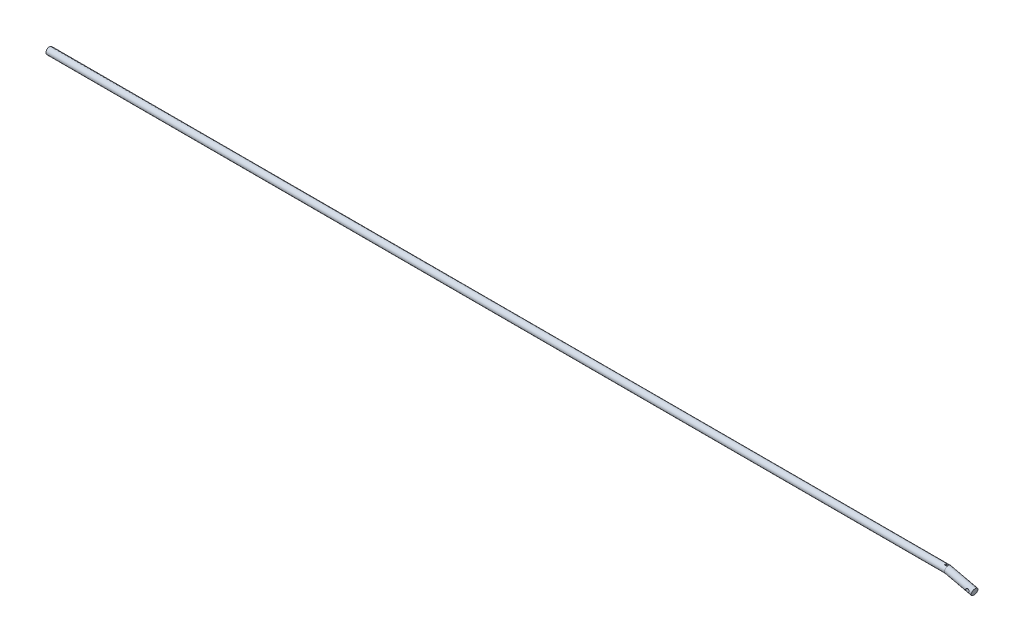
ISO-10303-21;
HEADER;
FILE_DESCRIPTION(('STEP AP214'),'2;1');
FILE_NAME('part.step','',(''),(''),'','','');
FILE_SCHEMA(('AUTOMOTIVE_DESIGN { 1 0 10303 214 1 1 1 1 }'));
ENDSEC;
DATA;
#1=APPLICATION_CONTEXT('core data for automotive mechanical design processes');
#2=APPLICATION_PROTOCOL_DEFINITION('international standard','automotive_design',2000,#1);
#3=PRODUCT_CONTEXT('',#1,'mechanical');
#4=PRODUCT('Part','Part','',(#3));
#5=PRODUCT_RELATED_PRODUCT_CATEGORY('part','',(#4));
#6=PRODUCT_DEFINITION_FORMATION('','',#4);
#7=PRODUCT_DEFINITION_CONTEXT('part definition',#1,'design');
#8=PRODUCT_DEFINITION('design','',#6,#7);
#9=PRODUCT_DEFINITION_SHAPE('','',#8);
#10=(LENGTH_UNIT() NAMED_UNIT(*) SI_UNIT(.MILLI.,.METRE.));
#11=(NAMED_UNIT(*) PLANE_ANGLE_UNIT() SI_UNIT($,.RADIAN.));
#12=(NAMED_UNIT(*) SI_UNIT($,.STERADIAN.) SOLID_ANGLE_UNIT());
#13=UNCERTAINTY_MEASURE_WITH_UNIT(LENGTH_MEASURE(1.E-05),#10,'distance_accuracy_value','');
#14=(GEOMETRIC_REPRESENTATION_CONTEXT(3) GLOBAL_UNCERTAINTY_ASSIGNED_CONTEXT((#13)) GLOBAL_UNIT_ASSIGNED_CONTEXT((#10,
#11,#12)) REPRESENTATION_CONTEXT('',''));
#15=CARTESIAN_POINT('',(0.,0.,0.));
#16=DIRECTION('',(0.,0.,1.));
#17=DIRECTION('',(1.,0.,0.));
#18=AXIS2_PLACEMENT_3D('',#15,#16,#17);
#19=CARTESIAN_POINT('',(1065.48022611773,0.,0.));
#20=DIRECTION('',(0.974370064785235,-0.224951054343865,0.));
#21=DIRECTION('',(0.224951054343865,0.974370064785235,0.));
#22=AXIS2_PLACEMENT_3D('',#19,#20,#21);
#23=CYLINDRICAL_SURFACE('',#22,4.);
#24=CARTESIAN_POINT('',(1094.3717638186,-6.67013704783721,-4.));
#25=CARTESIAN_POINT('',(1094.34915611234,-6.76803627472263,-3.99999513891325));
#26=CARTESIAN_POINT('',(1094.31871721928,-6.86426835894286,-3.9961727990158));
#27=CARTESIAN_POINT('',(1094.2432164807,-7.05034269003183,-3.98126038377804));
#28=CARTESIAN_POINT('',(1094.1981234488,-7.14017080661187,-3.97015475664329));
#29=CARTESIAN_POINT('',(1094.0951176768,-7.31059243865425,-3.94184589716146));
#30=CARTESIAN_POINT('',(1094.03725335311,-7.39121913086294,-3.92466555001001));
#31=CARTESIAN_POINT('',(1093.91040734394,-7.54186564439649,-3.88581306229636));
#32=CARTESIAN_POINT('',(1093.84142727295,-7.61188700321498,-3.86414157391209));
#33=CARTESIAN_POINT('',(1093.68989672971,-7.74375164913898,-3.81690967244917));
#34=CARTESIAN_POINT('',(1093.60680163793,-7.80491463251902,-3.79119919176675));
#35=CARTESIAN_POINT('',(1093.43189355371,-7.91302126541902,-3.73932387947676));
#36=CARTESIAN_POINT('',(1093.34007467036,-7.95995521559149,-3.71315875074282));
#37=CARTESIAN_POINT('',(1093.1429997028,-8.04121865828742,-3.66129888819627));
#38=CARTESIAN_POINT('',(1093.03725429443,-8.0744706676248,-3.63575784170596));
#39=CARTESIAN_POINT('',(1092.82039917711,-8.12218178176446,-3.59051183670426));
#40=CARTESIAN_POINT('',(1092.70929305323,-8.13665327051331,-3.57080303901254));
#41=CARTESIAN_POINT('',(1092.49139953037,-8.14545202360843,-3.54112541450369));
#42=CARTESIAN_POINT('',(1092.38472651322,-8.14087952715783,-3.53066583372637));
#43=CARTESIAN_POINT('',(1092.17320239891,-8.11376061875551,-3.51932216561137));
#44=CARTESIAN_POINT('',(1092.06834986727,-8.09122908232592,-3.51843016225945));
#45=CARTESIAN_POINT('',(1091.87506945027,-8.03230893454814,-3.5259205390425));
#46=CARTESIAN_POINT('',(1091.78607460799,-7.99762912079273,-3.53333630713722));
#47=CARTESIAN_POINT('',(1091.61493330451,-7.91575800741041,-3.5549317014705));
#48=CARTESIAN_POINT('',(1091.5327887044,-7.86856332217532,-3.56911315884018));
#49=CARTESIAN_POINT('',(1091.37531922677,-7.76191056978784,-3.60296787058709));
#50=CARTESIAN_POINT('',(1091.30019681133,-7.7021933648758,-3.62276091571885));
#51=CARTESIAN_POINT('',(1091.16023536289,-7.5727246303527,-3.6656024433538));
#52=CARTESIAN_POINT('',(1091.09540089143,-7.50296867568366,-3.68865236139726));
#53=CARTESIAN_POINT('',(1090.97030224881,-7.34642679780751,-3.73856394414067));
#54=CARTESIAN_POINT('',(1090.91138161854,-7.25860725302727,-3.76556206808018));
#55=CARTESIAN_POINT('',(1090.80873102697,-7.07407487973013,-3.8181912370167));
#56=CARTESIAN_POINT('',(1090.7650070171,-6.97735858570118,-3.84382174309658));
#57=CARTESIAN_POINT('',(1090.69270375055,-6.77325654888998,-3.89203005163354));
#58=CARTESIAN_POINT('',(1090.66476539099,-6.6656046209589,-3.91445422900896));
#59=CARTESIAN_POINT('',(1090.62808312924,-6.44591440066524,-3.95246172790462));
#60=CARTESIAN_POINT('',(1090.61932540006,-6.33387932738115,-3.96804997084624));
#61=CARTESIAN_POINT('',(1090.62173610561,-6.1178240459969,-3.98962347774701));
#62=CARTESIAN_POINT('',(1090.63141923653,-6.01385240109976,-3.99625687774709));
#63=CARTESIAN_POINT('',(1090.66776543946,-5.80873035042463,-4.00134617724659));
#64=CARTESIAN_POINT('',(1090.69442158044,-5.70757881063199,-3.99980541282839));
#65=CARTESIAN_POINT('',(1090.76137420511,-5.51814987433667,-3.98911404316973));
#66=CARTESIAN_POINT('',(1090.80061351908,-5.42946509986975,-3.98049091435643));
#67=CARTESIAN_POINT('',(1090.89167500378,-5.2597049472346,-3.95714383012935));
#68=CARTESIAN_POINT('',(1090.94349862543,-5.17863044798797,-3.94241917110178));
#69=CARTESIAN_POINT('',(1091.05989108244,-5.02354036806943,-3.90766805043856));
#70=CARTESIAN_POINT('',(1091.12479827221,-4.94981279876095,-3.88749457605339));
#71=CARTESIAN_POINT('',(1091.26457842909,-4.81364237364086,-3.84385718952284));
#72=CARTESIAN_POINT('',(1091.33945575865,-4.75120448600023,-3.82039183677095));
#73=CARTESIAN_POINT('',(1091.50474261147,-4.63353231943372,-3.76998560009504));
#74=CARTESIAN_POINT('',(1091.59594447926,-4.57946083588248,-3.74292234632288));
#75=CARTESIAN_POINT('',(1091.78640283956,-4.48706198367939,-3.69004347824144));
#76=CARTESIAN_POINT('',(1091.88566354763,-4.44874291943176,-3.66422852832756));
#77=CARTESIAN_POINT('',(1092.0938784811,-4.38795189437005,-3.61594344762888));
#78=CARTESIAN_POINT('',(1092.20305338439,-4.36610268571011,-3.59362791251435));
#79=CARTESIAN_POINT('',(1092.42479847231,-4.34187495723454,-3.55676249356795));
#80=CARTESIAN_POINT('',(1092.53736458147,-4.33947393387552,-3.54220365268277));
#81=CARTESIAN_POINT('',(1092.75167225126,-4.35408094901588,-3.52416084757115));
#82=CARTESIAN_POINT('',(1092.85345797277,-4.3693257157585,-3.51978212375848));
#83=CARTESIAN_POINT('',(1093.05319592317,-4.41606582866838,-3.52011316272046));
#84=CARTESIAN_POINT('',(1093.15114933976,-4.44755609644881,-3.52482008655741));
#85=CARTESIAN_POINT('',(1093.33261977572,-4.52247352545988,-3.54188021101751));
#86=CARTESIAN_POINT('',(1093.41666678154,-4.56477597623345,-3.55360734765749));
#87=CARTESIAN_POINT('',(1093.57690438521,-4.6607517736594,-3.58272305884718));
#88=CARTESIAN_POINT('',(1093.65309259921,-4.71442855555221,-3.60011334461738));
#89=CARTESIAN_POINT('',(1093.80103288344,-4.83564661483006,-3.64002283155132));
#90=CARTESIAN_POINT('',(1093.87214921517,-4.90387426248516,-3.6628069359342));
#91=CARTESIAN_POINT('',(1094.00275004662,-5.05007058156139,-3.71040953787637));
#92=CARTESIAN_POINT('',(1094.06222890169,-5.12804395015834,-3.73522901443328));
#93=CARTESIAN_POINT('',(1094.1741621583,-5.30094364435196,-3.78724151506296));
#94=CARTESIAN_POINT('',(1094.22521464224,-5.39679061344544,-3.81440887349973));
#95=CARTESIAN_POINT('',(1094.3105096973,-5.5965728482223,-3.86558707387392));
#96=CARTESIAN_POINT('',(1094.34474408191,-5.70051202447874,-3.889596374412));
#97=CARTESIAN_POINT('',(1094.39492418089,-5.91358610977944,-3.93178567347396));
#98=CARTESIAN_POINT('',(1094.41091806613,-6.02270653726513,-3.94998093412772));
#99=CARTESIAN_POINT('',(1094.42363896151,-6.24291496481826,-3.97846529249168));
#100=CARTESIAN_POINT('',(1094.42042294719,-6.35399617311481,-3.98877766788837));
#101=CARTESIAN_POINT('',(1094.40347446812,-6.49862906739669,-3.99635578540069));
#102=CARTESIAN_POINT('',(1094.39845755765,-6.53315262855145,-3.99771944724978));
#103=CARTESIAN_POINT('',(1094.38653027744,-6.60189691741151,-3.99954240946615));
#104=CARTESIAN_POINT('',(1094.37961986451,-6.63611763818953,-4.00000168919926));
#105=CARTESIAN_POINT('',(1094.3717638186,-6.67013704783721,-4.));
#106=B_SPLINE_CURVE_WITH_KNOTS('',3,(#24,#25,#26,#27,#28,#29,#30,#31,#32,#33,#34,#35,#36,#37,
#38,#39,#40,#41,#42,#43,#44,#45,#46,#47,#48,#49,#50,#51,#52,#53,#54,#55,#56,#57,#58,#59,#60,#61,
#62,#63,#64,#65,#66,#67,#68,#69,#70,#71,#72,#73,#74,#75,#76,#77,#78,#79,#80,#81,#82,#83,#84,#85,
#86,#87,#88,#89,#90,#91,#92,#93,#94,#95,#96,#97,#98,#99,#100,#101,#102,#103,#104,#105),
.UNSPECIFIED.,.T.,.F.,(4,2,2,2,2,2,2,2,2,2,2,2,2,2,2,2,2,2,2,2,2,2,2,2,2,2,2,2,2,2,2,2,2,2,2,2,
2,2,2,2,4),(0.,0.301284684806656,0.60321479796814,0.904019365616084,1.20478028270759,
1.52243530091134,1.84030636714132,2.17984884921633,2.51916732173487,2.83916232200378,
3.15889254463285,3.4449583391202,3.73110160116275,4.02388422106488,4.3167962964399,
4.64279563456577,4.96892249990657,5.30748206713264,5.64579749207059,5.95800956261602,
6.27009422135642,6.56084207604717,6.85162346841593,7.15120806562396,7.45092417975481,
7.77775629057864,8.1047604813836,8.44358241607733,8.78201224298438,9.08934291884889,
9.39657758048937,9.67981064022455,9.96312936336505,10.26536280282,10.567742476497,
10.9020050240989,11.2364301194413,11.5699699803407,11.9025210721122,12.0072133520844,
12.1119080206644),.UNSPECIFIED.);
#107=CARTESIAN_POINT('',(1094.3717638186,-6.67013704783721,-4.));
#108=VERTEX_POINT('',#107);
#109=EDGE_CURVE('E114',#108,#108,#106,.T.);
#110=ORIENTED_EDGE('',*,*,#109,.F.);
#111=EDGE_LOOP('',(#110));
#112=FACE_BOUND('',#111,.T.);
#113=CARTESIAN_POINT('',(1094.42046069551,-6.24273004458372,3.9770998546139));
#114=CARTESIAN_POINT('',(1094.42045609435,-6.13698537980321,3.96602324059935));
#115=CARTESIAN_POINT('',(1094.4115843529,-6.03147880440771,3.95110104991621));
#116=CARTESIAN_POINT('',(1094.37679012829,-5.82422289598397,3.91517405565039));
#117=CARTESIAN_POINT('',(1094.35081831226,-5.72248533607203,3.89415175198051));
#118=CARTESIAN_POINT('',(1094.28309890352,-5.52588895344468,3.84828353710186));
#119=CARTESIAN_POINT('',(1094.24142416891,-5.43100073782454,3.82345559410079));
#120=CARTESIAN_POINT('',(1094.14350319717,-5.24957042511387,3.77230275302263));
#121=CARTESIAN_POINT('',(1094.08725966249,-5.16302678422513,3.74597813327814));
#122=CARTESIAN_POINT('',(1093.95756128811,-4.99506894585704,3.69284919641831));
#123=CARTESIAN_POINT('',(1093.88327908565,-4.91426987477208,3.66611014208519));
#124=CARTESIAN_POINT('',(1093.72108110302,-4.76605536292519,3.61706522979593));
#125=CARTESIAN_POINT('',(1093.63316756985,-4.69863772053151,3.59475864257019));
#126=CARTESIAN_POINT('',(1093.44843483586,-4.58125974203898,3.55828252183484));
#127=CARTESIAN_POINT('',(1093.35194388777,-4.53085367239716,3.54389770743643));
#128=CARTESIAN_POINT('',(1093.1509803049,-4.44710761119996,3.5246156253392));
#129=CARTESIAN_POINT('',(1093.04651662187,-4.4137487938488,3.51970787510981));
#130=CARTESIAN_POINT('',(1092.84544944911,-4.36821714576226,3.52016951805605));
#131=CARTESIAN_POINT('',(1092.74927941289,-4.35408694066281,3.52444742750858));
#132=CARTESIAN_POINT('',(1092.55653735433,-4.34061722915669,3.54050713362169));
#133=CARTESIAN_POINT('',(1092.45996525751,-4.34128059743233,3.55229038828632));
#134=CARTESIAN_POINT('',(1092.26981370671,-4.35693895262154,3.58173250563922));
#135=CARTESIAN_POINT('',(1092.1762156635,-4.37181069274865,3.59933998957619));
#136=CARTESIAN_POINT('',(1091.99304673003,-4.41497252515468,3.63853975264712));
#137=CARTESIAN_POINT('',(1091.90347735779,-4.44326762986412,3.66013351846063));
#138=CARTESIAN_POINT('',(1091.72048971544,-4.51623976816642,3.7077265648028));
#139=CARTESIAN_POINT('',(1091.62770306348,-4.56235771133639,3.73394972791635));
#140=CARTESIAN_POINT('',(1091.45073791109,-4.66907861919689,3.78613528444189));
#141=CARTESIAN_POINT('',(1091.36656395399,-4.72968917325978,3.81209753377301));
#142=CARTESIAN_POINT('',(1091.20369293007,-4.86858214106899,3.86280448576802));
#143=CARTESIAN_POINT('',(1091.12568140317,-4.94774129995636,3.88736764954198));
#144=CARTESIAN_POINT('',(1090.98404870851,-5.11943061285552,3.9305872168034));
#145=CARTESIAN_POINT('',(1090.92041963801,-5.21195337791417,3.94924686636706));
#146=CARTESIAN_POINT('',(1090.81341797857,-5.40181127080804,3.97754902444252));
#147=CARTESIAN_POINT('',(1090.76904863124,-5.49851129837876,3.98767100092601));
#148=CARTESIAN_POINT('',(1090.69700748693,-5.69840763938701,3.99958676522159));
#149=CARTESIAN_POINT('',(1090.66932621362,-5.80160022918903,4.00138528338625));
#150=CARTESIAN_POINT('',(1090.63318867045,-6.00239858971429,3.99666167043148));
#151=CARTESIAN_POINT('',(1090.62335138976,-6.09977575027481,3.99080465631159));
#152=CARTESIAN_POINT('',(1090.61867011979,-6.2942529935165,3.97248879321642));
#153=CARTESIAN_POINT('',(1090.62382697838,-6.39135306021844,3.9600295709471));
#154=CARTESIAN_POINT('',(1090.64876519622,-6.58369450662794,3.92952643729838));
#155=CARTESIAN_POINT('',(1090.66868698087,-6.67890896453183,3.91142987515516));
#156=CARTESIAN_POINT('',(1090.72245717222,-6.86443869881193,3.87129808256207));
#157=CARTESIAN_POINT('',(1090.75631039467,-6.9547522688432,3.84926149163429));
#158=CARTESIAN_POINT('',(1090.84046141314,-7.13629231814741,3.80111081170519));
#159=CARTESIAN_POINT('',(1090.89192232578,-7.22693036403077,3.7748090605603));
#160=CARTESIAN_POINT('',(1091.00897272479,-7.39867798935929,3.72230357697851));
#161=CARTESIAN_POINT('',(1091.07457149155,-7.47978125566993,3.69609992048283));
#162=CARTESIAN_POINT('',(1091.2228713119,-7.63500588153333,3.64511428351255));
#163=CARTESIAN_POINT('',(1091.30634089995,-7.70845414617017,3.62050163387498));
#164=CARTESIAN_POINT('',(1091.48591263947,-7.8402546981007,3.57782209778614));
#165=CARTESIAN_POINT('',(1091.5820037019,-7.89862010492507,3.55974951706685));
#166=CARTESIAN_POINT('',(1091.77696718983,-7.99434725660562,3.53397173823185));
#167=CARTESIAN_POINT('',(1091.87516804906,-8.03289801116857,3.52562647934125));
#168=CARTESIAN_POINT('',(1092.07689951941,-8.09322099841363,3.51841728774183));
#169=CARTESIAN_POINT('',(1092.18042664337,-8.11500406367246,3.51954722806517));
#170=CARTESIAN_POINT('',(1092.37884370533,-8.13982129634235,3.53050625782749));
#171=CARTESIAN_POINT('',(1092.47358570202,-8.14448378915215,3.53947189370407));
#172=CARTESIAN_POINT('',(1092.66188682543,-8.13979981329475,3.56378071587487));
#173=CARTESIAN_POINT('',(1092.75544560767,-8.13044935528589,3.57912571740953));
#174=CARTESIAN_POINT('',(1092.94289902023,-8.09771143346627,3.61516286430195));
#175=CARTESIAN_POINT('',(1093.03666275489,-8.0737875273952,3.63604121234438));
#176=CARTESIAN_POINT('',(1093.21890122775,-8.01231741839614,3.68064953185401));
#177=CARTESIAN_POINT('',(1093.30737333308,-7.97476449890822,3.70438090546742));
#178=CARTESIAN_POINT('',(1093.48711012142,-7.88191721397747,3.75523841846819));
#179=CARTESIAN_POINT('',(1093.57757040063,-7.82510284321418,3.78244625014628));
#180=CARTESIAN_POINT('',(1093.74809811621,-7.69679110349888,3.8348805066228));
#181=CARTESIAN_POINT('',(1093.82816338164,-7.62529067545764,3.8601065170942));
#182=CARTESIAN_POINT('',(1093.97748246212,-7.46714175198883,3.90651471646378));
#183=CARTESIAN_POINT('',(1094.04643531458,-7.38017460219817,3.92758698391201));
#184=CARTESIAN_POINT('',(1094.16863974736,-7.19448353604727,3.96248989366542));
#185=CARTESIAN_POINT('',(1094.22189613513,-7.09576323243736,3.97632275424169));
#186=CARTESIAN_POINT('',(1094.30674146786,-6.89831176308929,3.9942687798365));
#187=CARTESIAN_POINT('',(1094.33975723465,-6.80025560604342,3.99909067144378));
#188=CARTESIAN_POINT('',(1094.38936843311,-6.60016316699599,4.00067030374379));
#189=CARTESIAN_POINT('',(1094.40600342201,-6.49813709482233,3.99744753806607));
#190=CARTESIAN_POINT('',(1094.41634315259,-6.37036339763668,3.98865616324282));
#191=CARTESIAN_POINT('',(1094.41788744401,-6.34483271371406,3.98666311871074));
#192=CARTESIAN_POINT('',(1094.41994667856,-6.29377341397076,3.98222124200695));
#193=CARTESIAN_POINT('',(1094.42046180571,-6.26824479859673,3.97977249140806));
#194=CARTESIAN_POINT('',(1094.42046069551,-6.24273004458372,3.9770998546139));
#195=B_SPLINE_CURVE_WITH_KNOTS('',3,(#113,#114,#115,#116,#117,#118,#119,#120,#121,#122,#123,
#124,#125,#126,#127,#128,#129,#130,#131,#132,#133,#134,#135,#136,#137,#138,#139,#140,#141,#142,
#143,#144,#145,#146,#147,#148,#149,#150,#151,#152,#153,#154,#155,#156,#157,#158,#159,#160,#161,
#162,#163,#164,#165,#166,#167,#168,#169,#170,#171,#172,#173,#174,#175,#176,#177,#178,#179,#180,
#181,#182,#183,#184,#185,#186,#187,#188,#189,#190,#191,#192,#193,#194),.UNSPECIFIED.,.T.,.F.,(4,
2,2,2,2,2,2,2,2,2,2,2,2,2,2,2,2,2,2,2,2,2,2,2,2,2,2,2,2,2,2,2,2,2,2,2,2,2,2,2,4),(0.,
0.318863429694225,0.638650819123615,0.956972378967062,1.27523493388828,1.61250700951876,
1.94972354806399,2.27725601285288,2.60442598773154,2.89488139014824,3.18539323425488,
3.47340777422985,3.76152994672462,4.08081689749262,4.40027141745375,4.73997861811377,
5.07949870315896,5.39836571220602,5.71705148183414,6.00980682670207,6.30257872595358,
6.5981714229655,6.89386638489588,7.21497056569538,7.53628617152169,7.8761460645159,
8.21570933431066,8.53137743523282,8.84684143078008,9.13138694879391,9.41601348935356,
9.71180936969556,10.0077512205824,10.3369665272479,10.6662504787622,11.0033330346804,
11.3403122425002,11.6494452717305,11.9578299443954,12.034781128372,12.1117185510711),.UNSPECIFIED.);
#196=CARTESIAN_POINT('',(1094.42046069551,-6.24273004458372,3.9770998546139));
#197=VERTEX_POINT('',#196);
#198=EDGE_CURVE('E108',#197,#197,#195,.T.);
#199=ORIENTED_EDGE('',*,*,#198,.F.);
#200=EDGE_LOOP('',(#199));
#201=FACE_BOUND('',#200,.T.);
#202=CARTESIAN_POINT('',(1065.48022611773,0.,0.));
#203=DIRECTION('',(0.993571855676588,-0.113203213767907,0.));
#204=DIRECTION('',(-0.113203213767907,-0.993571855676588,0.));
#205=AXIS2_PLACEMENT_3D('',#202,#203,#204);
#206=ELLIPSE('',#205,4.02587893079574,4.);
#207=CARTESIAN_POINT('',(1065.02448368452,-4.,0.));
#208=VERTEX_POINT('',#207);
#209=EDGE_CURVE('E102',#208,#208,#206,.T.);
#210=ORIENTED_EDGE('',*,*,#209,.T.);
#211=EDGE_LOOP('',(#210));
#212=FACE_BOUND('',#211,.T.);
#213=CARTESIAN_POINT('',(1097.1,-7.3,0.));
#214=DIRECTION('',(0.974370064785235,-0.224951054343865,0.));
#215=DIRECTION('',(0.224951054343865,0.974370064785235,0.));
#216=AXIS2_PLACEMENT_3D('',#213,#214,#215);
#217=CIRCLE('',#216,4.);
#218=CARTESIAN_POINT('',(1097.99980421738,-3.40251974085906,0.));
#219=VERTEX_POINT('',#218);
#220=EDGE_CURVE('E105',#219,#219,#217,.F.);
#221=ORIENTED_EDGE('',*,*,#220,.T.);
#222=EDGE_LOOP('',(#221));
#223=FACE_BOUND('',#222,.T.);
#224=ADVANCED_FACE('F33',(#112,#201,#212,#223),#23,.T.);
#225=CARTESIAN_POINT('',(1076.79393461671,0.,0.));
#226=DIRECTION('',(-1.,0.,0.));
#227=DIRECTION('',(0.,0.,1.));
#228=AXIS2_PLACEMENT_3D('',#225,#226,#227);
#229=CYLINDRICAL_SURFACE('',#228,4.);
#230=DIRECTION('',(-1.,0.,0.));
#231=VECTOR('',#230,1.);
#232=CARTESIAN_POINT('',(1076.79393461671,3.79005362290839,-1.278864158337));
#233=LINE('',#232,#231);
#234=CARTESIAN_POINT('',(1065.02448368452,3.79005362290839,-1.278864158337));
#235=VERTEX_POINT('',#234);
#236=CARTESIAN_POINT('',(1062.6786770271,3.79005362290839,-1.278864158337));
#237=VERTEX_POINT('',#236);
#238=EDGE_CURVE('E41',#235,#237,#233,.T.);
#239=ORIENTED_EDGE('',*,*,#238,.F.);
#240=CARTESIAN_POINT('',(1065.02448368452,0.,0.));
#241=DIRECTION('',(1.,0.,0.));
#242=DIRECTION('',(0.,0.,-1.));
#243=AXIS2_PLACEMENT_3D('',#240,#241,#242);
#244=CIRCLE('',#243,4.);
#245=CARTESIAN_POINT('',(1065.02448368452,3.79005362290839,1.278864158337));
#246=VERTEX_POINT('',#245);
#247=EDGE_CURVE('E12',#235,#246,#244,.T.);
#248=ORIENTED_EDGE('',*,*,#247,.T.);
#249=DIRECTION('',(-1.,0.,0.));
#250=VECTOR('',#249,1.);
#251=CARTESIAN_POINT('',(1076.79393461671,3.79005362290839,1.278864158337));
#252=LINE('',#251,#250);
#253=CARTESIAN_POINT('',(1062.6786770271,3.79005362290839,1.278864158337));
#254=VERTEX_POINT('',#253);
#255=EDGE_CURVE('E76',#246,#254,#252,.T.);
#256=ORIENTED_EDGE('',*,*,#255,.T.);
#257=CARTESIAN_POINT('',(1062.6786770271,0.,0.));
#258=DIRECTION('',(1.,0.,0.));
#259=DIRECTION('',(0.,0.,-1.));
#260=AXIS2_PLACEMENT_3D('',#257,#258,#259);
#261=CIRCLE('',#260,4.);
#262=EDGE_CURVE('E149',#237,#254,#261,.T.);
#263=ORIENTED_EDGE('',*,*,#262,.F.);
#264=EDGE_LOOP('',(#239,#248,#256,#263));
#265=FACE_BOUND('',#264,.T.);
#266=CARTESIAN_POINT('',(0.,0.,0.));
#267=DIRECTION('',(1.,0.,0.));
#268=DIRECTION('',(0.,0.,-1.));
#269=AXIS2_PLACEMENT_3D('',#266,#267,#268);
#270=CIRCLE('',#269,4.);
#271=CARTESIAN_POINT('',(0.,0.,-4.));
#272=VERTEX_POINT('',#271);
#273=EDGE_CURVE('E96',#272,#272,#270,.T.);
#274=ORIENTED_EDGE('',*,*,#273,.T.);
#275=EDGE_LOOP('',(#274));
#276=FACE_BOUND('',#275,.T.);
#277=ORIENTED_EDGE('',*,*,#209,.F.);
#278=EDGE_LOOP('',(#277));
#279=FACE_BOUND('',#278,.T.);
#280=ADVANCED_FACE('F132',(#265,#276,#279),#229,.T.);
#281=CARTESIAN_POINT('',(0.,0.,0.));
#282=DIRECTION('',(1.,0.,0.));
#283=DIRECTION('',(0.,0.,-1.));
#284=AXIS2_PLACEMENT_3D('',#281,#282,#283);
#285=PLANE('',#284);
#286=ORIENTED_EDGE('',*,*,#273,.F.);
#287=EDGE_LOOP('',(#286));
#288=FACE_BOUND('',#287,.T.);
#289=ADVANCED_FACE('F129',(#288),#285,.F.);
#290=CARTESIAN_POINT('',(1097.1,-7.30000000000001,0.));
#291=DIRECTION('',(0.974370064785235,-0.224951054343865,0.));
#292=DIRECTION('',(0.224951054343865,0.974370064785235,0.));
#293=AXIS2_PLACEMENT_3D('',#290,#291,#292);
#294=PLANE('',#293);
#295=ORIENTED_EDGE('',*,*,#220,.F.);
#296=EDGE_LOOP('',(#295));
#297=FACE_BOUND('',#296,.T.);
#298=ADVANCED_FACE('F123',(#297),#294,.T.);
#299=CARTESIAN_POINT('',(1092.52046069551,-6.24273004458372,-4.));
#300=DIRECTION('',(0.,0.,1.));
#301=DIRECTION('',(1.,0.,0.));
#302=AXIS2_PLACEMENT_3D('',#299,#300,#301);
#303=CYLINDRICAL_SURFACE('',#302,1.90000000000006);
#304=ORIENTED_EDGE('',*,*,#109,.T.);
#305=EDGE_LOOP('',(#304));
#306=FACE_BOUND('',#305,.T.);
#307=ORIENTED_EDGE('',*,*,#198,.T.);
#308=EDGE_LOOP('',(#307));
#309=FACE_BOUND('',#308,.T.);
#310=ADVANCED_FACE('F118',(#306,#309),#303,.F.);
#311=CARTESIAN_POINT('',(1065.02448368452,13.5,-1.278864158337));
#312=DIRECTION('',(1.,0.,0.));
#313=DIRECTION('',(0.,0.,-1.));
#314=AXIS2_PLACEMENT_3D('',#311,#312,#313);
#315=PLANE('',#314);
#316=DIRECTION('',(0.,-1.,0.));
#317=VECTOR('',#316,1.);
#318=CARTESIAN_POINT('',(1065.02448368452,13.5,-1.278864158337));
#319=LINE('',#318,#317);
#320=CARTESIAN_POINT('',(1065.02448368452,2.5,-1.278864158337));
#321=VERTEX_POINT('',#320);
#322=EDGE_CURVE('E90',#235,#321,#319,.T.);
#323=ORIENTED_EDGE('',*,*,#322,.T.);
#324=DIRECTION('',(0.,0.,1.));
#325=VECTOR('',#324,1.);
#326=CARTESIAN_POINT('',(1065.02448368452,2.5,-1.278864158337));
#327=LINE('',#326,#325);
#328=CARTESIAN_POINT('',(1065.02448368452,2.5,1.278864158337));
#329=VERTEX_POINT('',#328);
#330=EDGE_CURVE('E84',#321,#329,#327,.T.);
#331=ORIENTED_EDGE('',*,*,#330,.T.);
#332=DIRECTION('',(0.,-1.,0.));
#333=VECTOR('',#332,1.);
#334=CARTESIAN_POINT('',(1065.02448368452,13.5,1.278864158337));
#335=LINE('',#334,#333);
#336=EDGE_CURVE('E70',#246,#329,#335,.T.);
#337=ORIENTED_EDGE('',*,*,#336,.F.);
#338=ORIENTED_EDGE('',*,*,#247,.F.);
#339=EDGE_LOOP('',(#323,#331,#337,#338));
#340=FACE_BOUND('',#339,.T.);
#341=ADVANCED_FACE('F89',(#340),#315,.F.);
#342=CARTESIAN_POINT('',(1065.02448368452,13.5,-1.278864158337));
#343=DIRECTION('',(0.,0.,1.));
#344=DIRECTION('',(1.,0.,0.));
#345=AXIS2_PLACEMENT_3D('',#342,#343,#344);
#346=PLANE('',#345);
#347=ORIENTED_EDGE('',*,*,#238,.T.);
#348=DIRECTION('',(0.,-1.,0.));
#349=VECTOR('',#348,1.);
#350=CARTESIAN_POINT('',(1062.6786770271,13.5,-1.278864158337));
#351=LINE('',#350,#349);
#352=CARTESIAN_POINT('',(1062.6786770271,2.5,-1.278864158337));
#353=VERTEX_POINT('',#352);
#354=EDGE_CURVE('E97',#237,#353,#351,.T.);
#355=ORIENTED_EDGE('',*,*,#354,.T.);
#356=DIRECTION('',(-1.,0.,0.));
#357=VECTOR('',#356,1.);
#358=CARTESIAN_POINT('',(1065.02448368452,2.5,-1.278864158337));
#359=LINE('',#358,#357);
#360=EDGE_CURVE('E78',#321,#353,#359,.T.);
#361=ORIENTED_EDGE('',*,*,#360,.F.);
#362=ORIENTED_EDGE('',*,*,#322,.F.);
#363=EDGE_LOOP('',(#347,#355,#361,#362));
#364=FACE_BOUND('',#363,.T.);
#365=ADVANCED_FACE('F160',(#364),#346,.T.);
#366=CARTESIAN_POINT('',(1062.6786770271,13.5,-1.278864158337));
#367=DIRECTION('',(1.,0.,0.));
#368=DIRECTION('',(0.,0.,-1.));
#369=AXIS2_PLACEMENT_3D('',#366,#367,#368);
#370=PLANE('',#369);
#371=ORIENTED_EDGE('',*,*,#262,.T.);
#372=DIRECTION('',(0.,-1.,0.));
#373=VECTOR('',#372,1.);
#374=CARTESIAN_POINT('',(1062.6786770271,13.5,1.278864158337));
#375=LINE('',#374,#373);
#376=CARTESIAN_POINT('',(1062.6786770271,2.5,1.278864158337));
#377=VERTEX_POINT('',#376);
#378=EDGE_CURVE('E48',#254,#377,#375,.T.);
#379=ORIENTED_EDGE('',*,*,#378,.T.);
#380=DIRECTION('',(0.,0.,1.));
#381=VECTOR('',#380,1.);
#382=CARTESIAN_POINT('',(1062.6786770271,2.5,-1.278864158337));
#383=LINE('',#382,#381);
#384=EDGE_CURVE('E87',#353,#377,#383,.T.);
#385=ORIENTED_EDGE('',*,*,#384,.F.);
#386=ORIENTED_EDGE('',*,*,#354,.F.);
#387=EDGE_LOOP('',(#371,#379,#385,#386));
#388=FACE_BOUND('',#387,.T.);
#389=ADVANCED_FACE('F159',(#388),#370,.T.);
#390=CARTESIAN_POINT('',(1065.02448368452,13.5,1.278864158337));
#391=DIRECTION('',(0.,0.,1.));
#392=DIRECTION('',(1.,0.,0.));
#393=AXIS2_PLACEMENT_3D('',#390,#391,#392);
#394=PLANE('',#393);
#395=ORIENTED_EDGE('',*,*,#336,.T.);
#396=DIRECTION('',(-1.,0.,0.));
#397=VECTOR('',#396,1.);
#398=CARTESIAN_POINT('',(1065.02448368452,2.5,1.278864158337));
#399=LINE('',#398,#397);
#400=EDGE_CURVE('E73',#329,#377,#399,.T.);
#401=ORIENTED_EDGE('',*,*,#400,.T.);
#402=ORIENTED_EDGE('',*,*,#378,.F.);
#403=ORIENTED_EDGE('',*,*,#255,.F.);
#404=EDGE_LOOP('',(#395,#401,#402,#403));
#405=FACE_BOUND('',#404,.T.);
#406=ADVANCED_FACE('F72',(#405),#394,.F.);
#407=CARTESIAN_POINT('',(1065.02448368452,2.5,1.278864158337));
#408=DIRECTION('',(0.,-1.,0.));
#409=DIRECTION('',(1.,0.,0.));
#410=AXIS2_PLACEMENT_3D('',#407,#408,#409);
#411=PLANE('',#410);
#412=ORIENTED_EDGE('',*,*,#330,.F.);
#413=ORIENTED_EDGE('',*,*,#360,.T.);
#414=ORIENTED_EDGE('',*,*,#384,.T.);
#415=ORIENTED_EDGE('',*,*,#400,.F.);
#416=EDGE_LOOP('',(#412,#413,#414,#415));
#417=FACE_BOUND('',#416,.T.);
#418=ADVANCED_FACE('F82',(#417),#411,.F.);
#419=CLOSED_SHELL('',(#224,#280,#289,#298,#310,#341,#365,#389,#406,#418));
#420=MANIFOLD_SOLID_BREP('B2',#419);
#421=ADVANCED_BREP_SHAPE_REPRESENTATION('',(#18,#420),#14);
#422=SHAPE_DEFINITION_REPRESENTATION(#9,#421);
ENDSEC;
END-ISO-10303-21;
